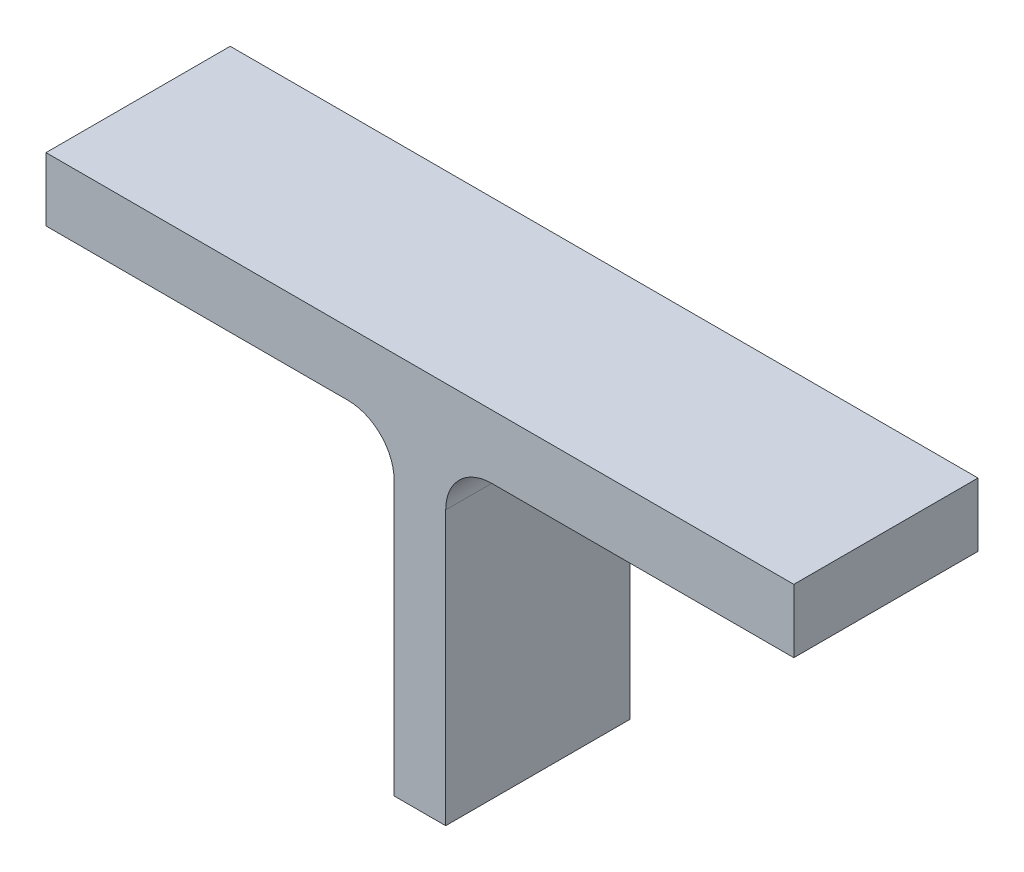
from build123d import *

# Parameters (mm, degrees)
BASESTEELWT_DEPTH = 12.7


with BuildPart() as part:
    # Sketch1 → BaseSteelWT (new, symmetric)
    with BuildSketch(Plane.XY):
        with BuildLine():
            Line((-3.55599692, 0), (3.55599692, 0))
            Line((3.55599692, 0), (3.55599692, 37.71901309))
            ThreePointArc((3.55599692, 37.71901309), (5.415867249, 42.209137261), (9.90599142, 44.06900759))
            Line((9.90599142, 44.06900759), (51.56195534, 44.06900759))
            Line((51.56195534, 44.06900759), (51.56195534, 52.832))
            Line((51.56195534, 52.832), (-51.56195534, 52.832))
            Line((-51.56195534, 52.832), (-51.56195534, 44.06900759))
            Line((-51.56195534, 44.06900759), (-9.90599142, 44.06900759))
            ThreePointArc((-9.90599142, 44.06900759), (-5.415867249, 42.209137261), (-3.55599692, 37.71901309))
            Line((-3.55599692, 37.71901309), (-3.55599692, 0))
        make_face()
    extrude(amount=BASESTEELWT_DEPTH, both=True)


solid = part.part
